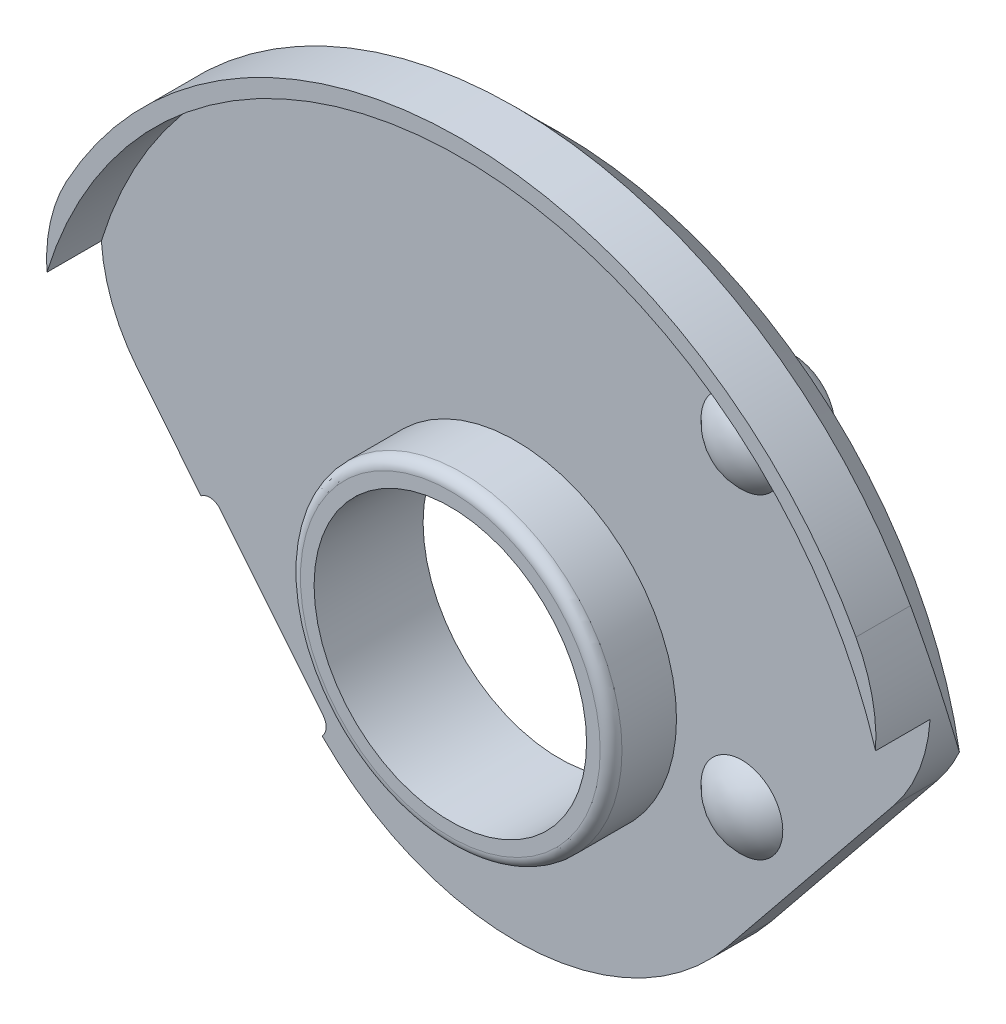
ISO-10303-21;
HEADER;
FILE_DESCRIPTION(('STEP AP214'),'2;1');
FILE_NAME('part.step','',(''),(''),'','','');
FILE_SCHEMA(('AUTOMOTIVE_DESIGN { 1 0 10303 214 1 1 1 1 }'));
ENDSEC;
DATA;
#1=APPLICATION_CONTEXT('core data for automotive mechanical design processes');
#2=APPLICATION_PROTOCOL_DEFINITION('international standard','automotive_design',2000,#1);
#3=PRODUCT_CONTEXT('',#1,'mechanical');
#4=PRODUCT('Part','Part','',(#3));
#5=PRODUCT_RELATED_PRODUCT_CATEGORY('part','',(#4));
#6=PRODUCT_DEFINITION_FORMATION('','',#4);
#7=PRODUCT_DEFINITION_CONTEXT('part definition',#1,'design');
#8=PRODUCT_DEFINITION('design','',#6,#7);
#9=PRODUCT_DEFINITION_SHAPE('','',#8);
#10=(LENGTH_UNIT() NAMED_UNIT(*) SI_UNIT(.MILLI.,.METRE.));
#11=(NAMED_UNIT(*) PLANE_ANGLE_UNIT() SI_UNIT($,.RADIAN.));
#12=(NAMED_UNIT(*) SI_UNIT($,.STERADIAN.) SOLID_ANGLE_UNIT());
#13=UNCERTAINTY_MEASURE_WITH_UNIT(LENGTH_MEASURE(1.E-05),#10,'distance_accuracy_value','');
#14=(GEOMETRIC_REPRESENTATION_CONTEXT(3) GLOBAL_UNCERTAINTY_ASSIGNED_CONTEXT((#13)) GLOBAL_UNIT_ASSIGNED_CONTEXT((#10,
#11,#12)) REPRESENTATION_CONTEXT('',''));
#15=CARTESIAN_POINT('',(0.,0.,0.));
#16=DIRECTION('',(0.,0.,1.));
#17=DIRECTION('',(1.,0.,0.));
#18=AXIS2_PLACEMENT_3D('',#15,#16,#17);
#19=CARTESIAN_POINT('',(3.,4.,-2.2));
#20=DIRECTION('',(0.,0.,1.));
#21=DIRECTION('',(1.,0.,0.));
#22=AXIS2_PLACEMENT_3D('',#19,#20,#21);
#23=PLANE('',#22);
#24=CARTESIAN_POINT('',(3.,4.,-2.2));
#25=DIRECTION('',(0.,0.,-1.));
#26=DIRECTION('',(-1.,0.,0.));
#27=AXIS2_PLACEMENT_3D('',#24,#25,#26);
#28=CIRCLE('',#27,0.460000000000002);
#29=CARTESIAN_POINT('',(2.54,4.,-2.2));
#30=VERTEX_POINT('',#29);
#31=EDGE_CURVE('E20',#30,#30,#28,.F.);
#32=ORIENTED_EDGE('',*,*,#31,.F.);
#33=EDGE_LOOP('',(#32));
#34=FACE_BOUND('',#33,.T.);
#35=ADVANCED_FACE('F16',(#34),#23,.F.);
#36=CARTESIAN_POINT('',(3.,4.,-1.7));
#37=DIRECTION('',(0.,0.,-1.));
#38=DIRECTION('',(-1.,0.,0.));
#39=AXIS2_PLACEMENT_3D('',#36,#37,#38);
#40=DEGENERATE_TOROIDAL_SURFACE('',#39,0.46,0.5,.T.);
#41=ORIENTED_EDGE('',*,*,#31,.T.);
#42=EDGE_LOOP('',(#41));
#43=FACE_BOUND('',#42,.T.);
#44=CARTESIAN_POINT('',(3.,4.,-1.7));
#45=DIRECTION('',(0.,0.,-1.));
#46=DIRECTION('',(-1.,0.,0.));
#47=AXIS2_PLACEMENT_3D('',#44,#45,#46);
#48=CIRCLE('',#47,0.96);
#49=CARTESIAN_POINT('',(2.04,4.,-1.7));
#50=VERTEX_POINT('',#49);
#51=EDGE_CURVE('E119',#50,#50,#48,.F.);
#52=ORIENTED_EDGE('',*,*,#51,.F.);
#53=EDGE_LOOP('',(#52));
#54=FACE_BOUND('',#53,.T.);
#55=ADVANCED_FACE('F18',(#43,#54),#40,.T.);
#56=CARTESIAN_POINT('',(3.,4.,0.));
#57=DIRECTION('',(0.,0.,-1.));
#58=DIRECTION('',(-1.,0.,0.));
#59=AXIS2_PLACEMENT_3D('',#56,#57,#58);
#60=CYLINDRICAL_SURFACE('',#59,0.96);
#61=ORIENTED_EDGE('',*,*,#51,.T.);
#62=EDGE_LOOP('',(#61));
#63=FACE_BOUND('',#62,.T.);
#64=CARTESIAN_POINT('',(3.,4.,-0.8));
#65=DIRECTION('',(0.,0.,-1.));
#66=DIRECTION('',(-1.,0.,0.));
#67=AXIS2_PLACEMENT_3D('',#64,#65,#66);
#68=CIRCLE('',#67,0.96);
#69=CARTESIAN_POINT('',(2.04,4.,-0.8));
#70=VERTEX_POINT('',#69);
#71=EDGE_CURVE('E139',#70,#70,#68,.T.);
#72=ORIENTED_EDGE('',*,*,#71,.T.);
#73=EDGE_LOOP('',(#72));
#74=FACE_BOUND('',#73,.T.);
#75=ADVANCED_FACE('F504',(#63,#74),#60,.T.);
#76=CARTESIAN_POINT('',(0.,0.,0.));
#77=DIRECTION('',(0.,0.,-1.));
#78=DIRECTION('',(-1.,0.,0.));
#79=AXIS2_PLACEMENT_3D('',#76,#77,#78);
#80=CYLINDRICAL_SURFACE('',#79,2.5);
#81=CARTESIAN_POINT('',(0.,0.,-0.8));
#82=DIRECTION('',(0.,0.,-1.));
#83=DIRECTION('',(-1.,0.,0.));
#84=AXIS2_PLACEMENT_3D('',#81,#82,#83);
#85=CIRCLE('',#84,2.5);
#86=CARTESIAN_POINT('',(-2.5,0.,-0.8));
#87=VERTEX_POINT('',#86);
#88=EDGE_CURVE('E142',#87,#87,#85,.T.);
#89=ORIENTED_EDGE('',*,*,#88,.T.);
#90=EDGE_LOOP('',(#89));
#91=FACE_BOUND('',#90,.T.);
#92=CARTESIAN_POINT('',(0.,0.,1.2));
#93=DIRECTION('',(0.,0.,-1.));
#94=DIRECTION('',(-1.,0.,0.));
#95=AXIS2_PLACEMENT_3D('',#92,#93,#94);
#96=CIRCLE('',#95,2.5);
#97=CARTESIAN_POINT('',(-2.5,0.,1.2));
#98=VERTEX_POINT('',#97);
#99=EDGE_CURVE('E132',#98,#98,#96,.F.);
#100=ORIENTED_EDGE('',*,*,#99,.T.);
#101=EDGE_LOOP('',(#100));
#102=FACE_BOUND('',#101,.T.);
#103=ADVANCED_FACE('F498',(#91,#102),#80,.F.);
#104=CARTESIAN_POINT('',(0.,0.,0.));
#105=DIRECTION('',(0.,0.,-1.));
#106=DIRECTION('',(-1.,0.,0.));
#107=AXIS2_PLACEMENT_3D('',#104,#105,#106);
#108=CYLINDRICAL_SURFACE('',#107,8.25);
#109=CARTESIAN_POINT('',(0.,0.,1.));
#110=DIRECTION('',(0.,0.,-1.));
#111=DIRECTION('',(-1.,0.,0.));
#112=AXIS2_PLACEMENT_3D('',#109,#110,#111);
#113=CIRCLE('',#112,8.25);
#114=CARTESIAN_POINT('',(7.24285548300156,3.95013220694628,1.));
#115=VERTEX_POINT('',#114);
#116=CARTESIAN_POINT('',(-7.24285548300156,3.95013220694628,1.));
#117=VERTEX_POINT('',#116);
#118=EDGE_CURVE('E112',#115,#117,#113,.F.);
#119=ORIENTED_EDGE('',*,*,#118,.F.);
#120=DIRECTION('',(0.,0.,-1.));
#121=VECTOR('',#120,1.);
#122=CARTESIAN_POINT('',(7.24285548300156,3.95013220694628,0.));
#123=LINE('',#122,#121);
#124=CARTESIAN_POINT('',(7.24285548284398,3.95013220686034,5.38473404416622E-10));
#125=VERTEX_POINT('',#124);
#126=EDGE_CURVE('E103',#115,#125,#123,.T.);
#127=ORIENTED_EDGE('',*,*,#126,.T.);
#128=CARTESIAN_POINT('',(0.,0.,3.5898367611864E-10));
#129=DIRECTION('',(0.,0.,1.));
#130=DIRECTION('',(0.,1.,0.));
#131=AXIS2_PLACEMENT_3D('',#128,#129,#130);
#132=CIRCLE('',#131,8.24999999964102);
#133=CARTESIAN_POINT('',(-7.24285548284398,3.95013220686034,5.38473404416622E-10));
#134=VERTEX_POINT('',#133);
#135=EDGE_CURVE('E115',#134,#125,#132,.F.);
#136=ORIENTED_EDGE('',*,*,#135,.F.);
#137=DIRECTION('',(0.,0.,-1.));
#138=VECTOR('',#137,1.);
#139=CARTESIAN_POINT('',(-7.24285548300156,3.95013220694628,0.));
#140=LINE('',#139,#138);
#141=EDGE_CURVE('E108',#134,#117,#140,.F.);
#142=ORIENTED_EDGE('',*,*,#141,.T.);
#143=EDGE_LOOP('',(#119,#127,#136,#142));
#144=FACE_BOUND('',#143,.T.);
#145=ADVANCED_FACE('F110',(#144),#108,.T.);
#146=CARTESIAN_POINT('',(4.25,5.1,-0.561437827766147));
#147=DIRECTION('',(1.,0.,0.));
#148=DIRECTION('',(0.,1.,0.));
#149=AXIS2_PLACEMENT_3D('',#146,#147,#148);
#150=SPHERICAL_SURFACE('',#149,1.);
#151=CARTESIAN_POINT('',(4.25,4.35,0.1));
#152=CARTESIAN_POINT('',(4.2078721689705,4.35000186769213,0.0999999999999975));
#153=CARTESIAN_POINT('',(4.16571379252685,4.35356141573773,0.1));
#154=CARTESIAN_POINT('',(4.08255809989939,4.36771177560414,0.0999999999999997));
#155=CARTESIAN_POINT('',(4.04156224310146,4.37831104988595,0.0999999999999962));
#156=CARTESIAN_POINT('',(3.96195370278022,4.40623722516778,0.0999999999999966));
#157=CARTESIAN_POINT('',(3.92333957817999,4.42356001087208,0.100000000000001));
#158=CARTESIAN_POINT('',(3.84956802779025,4.46444278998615,0.0999999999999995));
#159=CARTESIAN_POINT('',(3.81441066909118,4.48800290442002,0.0999999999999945));
#160=CARTESIAN_POINT('',(3.7485510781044,4.54069042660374,0.100000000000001));
#161=CARTESIAN_POINT('',(3.71784871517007,4.56981767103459,0.100000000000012));
#162=CARTESIAN_POINT('',(3.66176867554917,4.63281438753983,0.0999999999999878));
#163=CARTESIAN_POINT('',(3.63639120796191,4.66668404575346,0.0999999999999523));
#164=CARTESIAN_POINT('',(3.59168322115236,4.73820253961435,0.0999999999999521));
#165=CARTESIAN_POINT('',(3.57235258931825,4.77585130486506,0.0999999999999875));
#166=CARTESIAN_POINT('',(3.54028642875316,4.85385972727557,0.100000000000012));
#167=CARTESIAN_POINT('',(3.52755088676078,4.89421937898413,0.100000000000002));
#168=CARTESIAN_POINT('',(3.50903634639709,4.97650402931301,0.0999999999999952));
#169=CARTESIAN_POINT('',(3.50325736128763,5.01842903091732,0.099999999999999));
#170=CARTESIAN_POINT('',(3.49882003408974,5.10265410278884,0.100000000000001));
#171=CARTESIAN_POINT('',(3.50016167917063,5.14495417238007,0.0999999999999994));
#172=CARTESIAN_POINT('',(3.509927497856,5.22872869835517,0.0999999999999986));
#173=CARTESIAN_POINT('',(3.51835167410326,5.27020315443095,0.0999999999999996));
#174=CARTESIAN_POINT('',(3.54204343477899,5.3511491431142,0.1));
#175=CARTESIAN_POINT('',(3.55731102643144,5.39062067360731,0.1));
#176=CARTESIAN_POINT('',(3.59425621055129,5.46644027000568,0.100000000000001));
#177=CARTESIAN_POINT('',(3.61593380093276,5.50278833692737,0.100000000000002));
#178=CARTESIAN_POINT('',(3.66508361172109,5.57132919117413,0.0999999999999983));
#179=CARTESIAN_POINT('',(3.69255582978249,5.60352198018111,0.0999999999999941));
#180=CARTESIAN_POINT('',(3.75251504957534,5.66283844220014,0.100000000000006));
#181=CARTESIAN_POINT('',(3.78500205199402,5.68996211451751,0.100000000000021));
#182=CARTESIAN_POINT('',(3.85406863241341,5.73837037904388,0.0999999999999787));
#183=CARTESIAN_POINT('',(3.89064821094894,5.75965497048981,0.0999999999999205));
#184=CARTESIAN_POINT('',(3.9668615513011,5.79578086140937,0.0999999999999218));
#185=CARTESIAN_POINT('',(4.00649531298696,5.81062216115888,0.0999999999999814));
#186=CARTESIAN_POINT('',(4.08769193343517,5.83344016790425,0.100000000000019));
#187=CARTESIAN_POINT('',(4.12925479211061,5.84141687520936,0.0999999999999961));
#188=CARTESIAN_POINT('',(4.21312976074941,5.85027926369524,0.0999999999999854));
#189=CARTESIAN_POINT('',(4.25544187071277,5.85116494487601,0.0999999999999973));
#190=CARTESIAN_POINT('',(4.33961422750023,5.84582013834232,0.100000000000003));
#191=CARTESIAN_POINT('',(4.38147447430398,5.83958965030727,0.0999999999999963));
#192=CARTESIAN_POINT('',(4.46355481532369,5.82018937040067,0.0999999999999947));
#193=CARTESIAN_POINT('',(4.50377490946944,5.80701957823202,0.0999999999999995));
#194=CARTESIAN_POINT('',(4.58143320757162,5.77411454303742,0.100000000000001));
#195=CARTESIAN_POINT('',(4.6188714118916,5.75437930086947,0.0999999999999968));
#196=CARTESIAN_POINT('',(4.68990317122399,5.70890359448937,0.0999999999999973));
#197=CARTESIAN_POINT('',(4.72349672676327,5.68316313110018,0.100000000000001));
#198=CARTESIAN_POINT('',(4.78588558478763,5.62640766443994,0.0999999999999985));
#199=CARTESIAN_POINT('',(4.81468088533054,5.59539265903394,0.0999999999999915));
#200=CARTESIAN_POINT('',(4.86665581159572,5.52896853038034,0.0999999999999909));
#201=CARTESIAN_POINT('',(4.88983543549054,5.49355940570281,0.0999999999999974));
#202=CARTESIAN_POINT('',(4.92992097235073,5.41935224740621,0.100000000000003));
#203=CARTESIAN_POINT('',(4.94682689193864,5.38055421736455,0.100000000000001));
#204=CARTESIAN_POINT('',(4.97388514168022,5.30067059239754,0.1));
#205=CARTESIAN_POINT('',(4.98403747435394,5.25958499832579,0.1));
#206=CARTESIAN_POINT('',(4.99730037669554,5.17629245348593,0.1));
#207=CARTESIAN_POINT('',(5.00041093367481,5.13408550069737,0.1));
#208=CARTESIAN_POINT('',(4.99950195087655,5.04974852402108,0.1));
#209=CARTESIAN_POINT('',(4.99548242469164,5.00761849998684,0.1));
#210=CARTESIAN_POINT('',(4.98042738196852,4.92463116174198,0.0999999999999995));
#211=CARTESIAN_POINT('',(4.96939185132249,4.88377385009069,0.0999999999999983));
#212=CARTESIAN_POINT('',(4.94061780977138,4.8044911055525,0.100000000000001));
#213=CARTESIAN_POINT('',(4.922879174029,4.76606571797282,0.100000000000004));
#214=CARTESIAN_POINT('',(4.88120323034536,4.69273991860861,0.0999999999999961));
#215=CARTESIAN_POINT('',(4.85726616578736,4.65783936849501,0.0999999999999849));
#216=CARTESIAN_POINT('',(4.80387210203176,4.59255127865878,0.100000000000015));
#217=CARTESIAN_POINT('',(4.77441494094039,4.56216387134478,0.100000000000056));
#218=CARTESIAN_POINT('',(4.71081655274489,4.50676632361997,0.0999999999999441));
#219=CARTESIAN_POINT('',(4.67667541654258,4.48175607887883,0.0999999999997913));
#220=CARTESIAN_POINT('',(4.60466112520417,4.43780914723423,0.0999999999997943));
#221=CARTESIAN_POINT('',(4.56678570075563,4.41887618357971,0.0999999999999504));
#222=CARTESIAN_POINT('',(4.4884235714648,4.38765954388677,0.10000000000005));
#223=CARTESIAN_POINT('',(4.447940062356,4.3753678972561,0.0999999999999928));
#224=CARTESIAN_POINT('',(4.38099879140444,4.36105879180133,0.0999999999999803));
#225=CARTESIAN_POINT('',(4.35497599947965,4.35691692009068,0.0999999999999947));
#226=CARTESIAN_POINT('',(4.30263944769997,4.35138694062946,0.100000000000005));
#227=CARTESIAN_POINT('',(4.27632568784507,4.34999883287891,0.100000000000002));
#228=CARTESIAN_POINT('',(4.25,4.35,0.1));
#229=B_SPLINE_CURVE_WITH_KNOTS('',3,(#151,#152,#153,#154,#155,#156,#157,#158,#159,#160,#161,
#162,#163,#164,#165,#166,#167,#168,#169,#170,#171,#172,#173,#174,#175,#176,#177,#178,#179,#180,
#181,#182,#183,#184,#185,#186,#187,#188,#189,#190,#191,#192,#193,#194,#195,#196,#197,#198,#199,
#200,#201,#202,#203,#204,#205,#206,#207,#208,#209,#210,#211,#212,#213,#214,#215,#216,#217,#218,
#219,#220,#221,#222,#223,#224,#225,#226,#227,#228),.UNSPECIFIED.,.T.,.F.,(4,2,2,2,2,2,2,2,2,2,2,
2,2,2,2,2,2,2,2,2,2,2,2,2,2,2,2,2,2,2,2,2,2,2,2,2,2,2,4),(0.,0.126287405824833,0.25272689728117,
0.37908911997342,0.505453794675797,0.631814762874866,0.758180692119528,0.884544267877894,
1.01090758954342,1.13727115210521,1.26363448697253,1.38999786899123,1.51636138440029,
1.64272485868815,1.76908828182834,1.89545172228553,2.02181517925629,2.14817863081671,
2.27454207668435,2.40090552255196,2.52726897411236,2.65363243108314,2.77999587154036,
2.90635929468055,3.03272276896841,3.15908628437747,3.28544966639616,3.41181300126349,
3.53817656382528,3.66453988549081,3.79090346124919,3.91726939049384,4.0436303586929,
4.1699950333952,4.29635725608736,4.42279674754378,4.5490841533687,4.62800117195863,
4.70691819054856),.UNSPECIFIED.);
#230=CARTESIAN_POINT('',(4.25,4.35,0.1));
#231=VERTEX_POINT('',#230);
#232=EDGE_CURVE('E147',#231,#231,#229,.T.);
#233=ORIENTED_EDGE('',*,*,#232,.F.);
#234=EDGE_LOOP('',(#233));
#235=FACE_BOUND('',#234,.T.);
#236=ADVANCED_FACE('F163',(#235),#150,.T.);
#237=CARTESIAN_POINT('',(4.25,-0.7,-0.561437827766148));
#238=DIRECTION('',(1.,0.,0.));
#239=DIRECTION('',(0.,1.,0.));
#240=AXIS2_PLACEMENT_3D('',#237,#238,#239);
#241=SPHERICAL_SURFACE('',#240,1.);
#242=CARTESIAN_POINT('',(4.25,-1.45,0.0999999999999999));
#243=CARTESIAN_POINT('',(4.2078721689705,-1.44999813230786,0.0999999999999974));
#244=CARTESIAN_POINT('',(4.16571379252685,-1.44643858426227,0.1));
#245=CARTESIAN_POINT('',(4.08255809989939,-1.43228822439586,0.0999999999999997));
#246=CARTESIAN_POINT('',(4.04156224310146,-1.42168895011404,0.0999999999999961));
#247=CARTESIAN_POINT('',(3.96195370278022,-1.39376277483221,0.0999999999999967));
#248=CARTESIAN_POINT('',(3.92333957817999,-1.37643998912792,0.100000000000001));
#249=CARTESIAN_POINT('',(3.84956802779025,-1.33555721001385,0.0999999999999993));
#250=CARTESIAN_POINT('',(3.81441066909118,-1.31199709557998,0.0999999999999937));
#251=CARTESIAN_POINT('',(3.7485510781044,-1.25930957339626,0.1));
#252=CARTESIAN_POINT('',(3.71784871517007,-1.23018232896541,0.100000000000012));
#253=CARTESIAN_POINT('',(3.66176867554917,-1.16718561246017,0.0999999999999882));
#254=CARTESIAN_POINT('',(3.63639120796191,-1.13331595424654,0.0999999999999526));
#255=CARTESIAN_POINT('',(3.59168322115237,-1.06179746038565,0.0999999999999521));
#256=CARTESIAN_POINT('',(3.57235258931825,-1.02414869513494,0.0999999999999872));
#257=CARTESIAN_POINT('',(3.54028642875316,-0.94614027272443,0.100000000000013));
#258=CARTESIAN_POINT('',(3.52755088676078,-0.905780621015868,0.100000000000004));
#259=CARTESIAN_POINT('',(3.50903634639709,-0.823495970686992,0.0999999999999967));
#260=CARTESIAN_POINT('',(3.50325736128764,-0.781570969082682,0.0999999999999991));
#261=CARTESIAN_POINT('',(3.49882003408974,-0.697345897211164,0.100000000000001));
#262=CARTESIAN_POINT('',(3.50016167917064,-0.655045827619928,0.1));
#263=CARTESIAN_POINT('',(3.509927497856,-0.571271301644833,0.0999999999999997));
#264=CARTESIAN_POINT('',(3.51835167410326,-0.529796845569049,0.1));
#265=CARTESIAN_POINT('',(3.542043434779,-0.448850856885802,0.1));
#266=CARTESIAN_POINT('',(3.55731102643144,-0.40937932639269,0.0999999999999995));
#267=CARTESIAN_POINT('',(3.59425621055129,-0.333559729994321,0.1));
#268=CARTESIAN_POINT('',(3.61593380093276,-0.297211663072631,0.100000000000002));
#269=CARTESIAN_POINT('',(3.66508361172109,-0.228670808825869,0.0999999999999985));
#270=CARTESIAN_POINT('',(3.69255582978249,-0.196478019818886,0.0999999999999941));
#271=CARTESIAN_POINT('',(3.75251504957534,-0.137161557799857,0.100000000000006));
#272=CARTESIAN_POINT('',(3.78500205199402,-0.110037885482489,0.100000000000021));
#273=CARTESIAN_POINT('',(3.85406863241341,-0.0616296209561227,0.0999999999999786));
#274=CARTESIAN_POINT('',(3.89064821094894,-0.0403450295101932,0.0999999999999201));
#275=CARTESIAN_POINT('',(3.9668615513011,-0.00421913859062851,0.0999999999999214));
#276=CARTESIAN_POINT('',(4.00649531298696,0.0106221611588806,0.0999999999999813));
#277=CARTESIAN_POINT('',(4.08769193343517,0.0334401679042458,0.100000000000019));
#278=CARTESIAN_POINT('',(4.12925479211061,0.041416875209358,0.0999999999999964));
#279=CARTESIAN_POINT('',(4.21312976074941,0.0502792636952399,0.0999999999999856));
#280=CARTESIAN_POINT('',(4.25544187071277,0.0511649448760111,0.0999999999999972));
#281=CARTESIAN_POINT('',(4.33961422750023,0.0458201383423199,0.100000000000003));
#282=CARTESIAN_POINT('',(4.38147447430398,0.0395896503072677,0.099999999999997));
#283=CARTESIAN_POINT('',(4.46355481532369,0.0201893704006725,0.0999999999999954));
#284=CARTESIAN_POINT('',(4.50377490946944,0.00701957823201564,0.0999999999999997));
#285=CARTESIAN_POINT('',(4.58143320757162,-0.025885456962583,0.1));
#286=CARTESIAN_POINT('',(4.6188714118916,-0.0456206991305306,0.0999999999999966));
#287=CARTESIAN_POINT('',(4.68990317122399,-0.0910964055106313,0.0999999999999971));
#288=CARTESIAN_POINT('',(4.72349672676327,-0.11683686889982,0.100000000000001));
#289=CARTESIAN_POINT('',(4.78588558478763,-0.173592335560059,0.0999999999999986));
#290=CARTESIAN_POINT('',(4.81468088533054,-0.204607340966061,0.0999999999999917));
#291=CARTESIAN_POINT('',(4.86665581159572,-0.271031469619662,0.0999999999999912));
#292=CARTESIAN_POINT('',(4.88983543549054,-0.306440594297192,0.0999999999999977));
#293=CARTESIAN_POINT('',(4.92992097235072,-0.380647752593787,0.100000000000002));
#294=CARTESIAN_POINT('',(4.94682689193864,-0.419445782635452,0.100000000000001));
#295=CARTESIAN_POINT('',(4.97388514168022,-0.499329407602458,0.0999999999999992));
#296=CARTESIAN_POINT('',(4.98403747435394,-0.540415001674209,0.0999999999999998));
#297=CARTESIAN_POINT('',(4.99730037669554,-0.623707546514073,0.1));
#298=CARTESIAN_POINT('',(5.00041093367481,-0.665914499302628,0.1));
#299=CARTESIAN_POINT('',(4.99950195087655,-0.750251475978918,0.1));
#300=CARTESIAN_POINT('',(4.99548242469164,-0.792381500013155,0.1));
#301=CARTESIAN_POINT('',(4.98042738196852,-0.875368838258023,0.0999999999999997));
#302=CARTESIAN_POINT('',(4.96939185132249,-0.916226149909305,0.0999999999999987));
#303=CARTESIAN_POINT('',(4.94061780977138,-0.995508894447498,0.100000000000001));
#304=CARTESIAN_POINT('',(4.92287917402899,-1.03393428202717,0.100000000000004));
#305=CARTESIAN_POINT('',(4.88120323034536,-1.10726008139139,0.0999999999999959));
#306=CARTESIAN_POINT('',(4.85726616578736,-1.14216063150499,0.0999999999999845));
#307=CARTESIAN_POINT('',(4.80387210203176,-1.20744872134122,0.100000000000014));
#308=CARTESIAN_POINT('',(4.77441494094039,-1.23783612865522,0.100000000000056));
#309=CARTESIAN_POINT('',(4.71081655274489,-1.29323367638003,0.0999999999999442));
#310=CARTESIAN_POINT('',(4.67667541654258,-1.31824392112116,0.0999999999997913));
#311=CARTESIAN_POINT('',(4.60466112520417,-1.36219085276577,0.0999999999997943));
#312=CARTESIAN_POINT('',(4.56678570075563,-1.38112381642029,0.0999999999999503));
#313=CARTESIAN_POINT('',(4.4884235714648,-1.41234045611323,0.10000000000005));
#314=CARTESIAN_POINT('',(4.447940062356,-1.4246321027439,0.0999999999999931));
#315=CARTESIAN_POINT('',(4.38099879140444,-1.43894120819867,0.0999999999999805));
#316=CARTESIAN_POINT('',(4.35497599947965,-1.44308307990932,0.0999999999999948));
#317=CARTESIAN_POINT('',(4.30263944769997,-1.44861305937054,0.100000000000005));
#318=CARTESIAN_POINT('',(4.27632568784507,-1.45000116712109,0.100000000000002));
#319=CARTESIAN_POINT('',(4.25,-1.45,0.0999999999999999));
#320=B_SPLINE_CURVE_WITH_KNOTS('',3,(#242,#243,#244,#245,#246,#247,#248,#249,#250,#251,#252,
#253,#254,#255,#256,#257,#258,#259,#260,#261,#262,#263,#264,#265,#266,#267,#268,#269,#270,#271,
#272,#273,#274,#275,#276,#277,#278,#279,#280,#281,#282,#283,#284,#285,#286,#287,#288,#289,#290,
#291,#292,#293,#294,#295,#296,#297,#298,#299,#300,#301,#302,#303,#304,#305,#306,#307,#308,#309,
#310,#311,#312,#313,#314,#315,#316,#317,#318,#319),.UNSPECIFIED.,.T.,.F.,(4,2,2,2,2,2,2,2,2,2,2,
2,2,2,2,2,2,2,2,2,2,2,2,2,2,2,2,2,2,2,2,2,2,2,2,2,2,2,4),(0.,0.126287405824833,0.25272689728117,
0.37908911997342,0.505453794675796,0.631814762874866,0.758180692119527,0.884544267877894,
1.01090758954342,1.13727115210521,1.26363448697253,1.38999786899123,1.51636138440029,
1.64272485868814,1.76908828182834,1.89545172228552,2.02181517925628,2.14817863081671,
2.27454207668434,2.40090552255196,2.52726897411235,2.65363243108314,2.77999587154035,
2.90635929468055,3.03272276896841,3.15908628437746,3.28544966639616,3.41181300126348,
3.53817656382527,3.66453988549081,3.79090346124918,3.91726939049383,4.04363035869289,
4.1699950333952,4.29635725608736,4.42279674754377,4.5490841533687,4.62800117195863,
4.70691819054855),.UNSPECIFIED.);
#321=CARTESIAN_POINT('',(4.25,-1.45,0.0999999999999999));
#322=VERTEX_POINT('',#321);
#323=EDGE_CURVE('E154',#322,#322,#320,.T.);
#324=ORIENTED_EDGE('',*,*,#323,.F.);
#325=EDGE_LOOP('',(#324));
#326=FACE_BOUND('',#325,.T.);
#327=ADVANCED_FACE('F168',(#326),#241,.T.);
#328=CARTESIAN_POINT('',(0.,0.,1.2));
#329=DIRECTION('',(0.,0.,-1.));
#330=DIRECTION('',(-1.,0.,0.));
#331=AXIS2_PLACEMENT_3D('',#328,#329,#330);
#332=PLANE('',#331);
#333=ORIENTED_EDGE('',*,*,#99,.F.);
#334=EDGE_LOOP('',(#333));
#335=FACE_BOUND('',#334,.T.);
#336=CARTESIAN_POINT('',(0.,0.,1.2));
#337=DIRECTION('',(0.,0.,-1.));
#338=DIRECTION('',(1.,0.,0.));
#339=AXIS2_PLACEMENT_3D('',#336,#337,#338);
#340=CIRCLE('',#339,2.75);
#341=CARTESIAN_POINT('',(2.75,0.,1.2));
#342=VERTEX_POINT('',#341);
#343=EDGE_CURVE('E284',#342,#342,#340,.T.);
#344=ORIENTED_EDGE('',*,*,#343,.F.);
#345=EDGE_LOOP('',(#344));
#346=FACE_BOUND('',#345,.T.);
#347=ADVANCED_FACE('F288',(#335,#346),#332,.F.);
#348=CARTESIAN_POINT('',(0.,5.77962089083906,1.));
#349=DIRECTION('',(0.,0.,1.));
#350=DIRECTION('',(1.,0.,0.));
#351=AXIS2_PLACEMENT_3D('',#348,#349,#350);
#352=PLANE('',#351);
#353=CARTESIAN_POINT('',(0.,0.,1.));
#354=DIRECTION('',(0.,0.,1.));
#355=DIRECTION('',(1.,0.,0.));
#356=AXIS2_PLACEMENT_3D('',#353,#354,#355);
#357=CIRCLE('',#356,7.95);
#358=CARTESIAN_POINT('',(-7.60302402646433,2.32304232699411,1.));
#359=VERTEX_POINT('',#358);
#360=CARTESIAN_POINT('',(7.60302402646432,2.32304232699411,1.));
#361=VERTEX_POINT('',#360);
#362=EDGE_CURVE('E246',#359,#361,#357,.F.);
#363=ORIENTED_EDGE('',*,*,#362,.T.);
#364=CARTESIAN_POINT('',(4.60908985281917,2.51372049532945,1.));
#365=DIRECTION('',(0.,0.,-1.));
#366=DIRECTION('',(-1.,0.,0.));
#367=AXIS2_PLACEMENT_3D('',#364,#365,#366);
#368=CIRCLE('',#367,3.);
#369=EDGE_CURVE('E129',#361,#115,#368,.F.);
#370=ORIENTED_EDGE('',*,*,#369,.T.);
#371=ORIENTED_EDGE('',*,*,#118,.T.);
#372=CARTESIAN_POINT('',(-4.60908985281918,2.51372049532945,1.));
#373=DIRECTION('',(0.,0.,-1.));
#374=DIRECTION('',(-1.,0.,0.));
#375=AXIS2_PLACEMENT_3D('',#372,#373,#374);
#376=CIRCLE('',#375,3.);
#377=EDGE_CURVE('E122',#117,#359,#376,.F.);
#378=ORIENTED_EDGE('',*,*,#377,.T.);
#379=EDGE_LOOP('',(#363,#370,#371,#378));
#380=FACE_BOUND('',#379,.T.);
#381=ADVANCED_FACE('F131',(#380),#352,.T.);
#382=CARTESIAN_POINT('',(0.,5.77962089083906,-0.8));
#383=DIRECTION('',(0.,0.,1.));
#384=DIRECTION('',(1.,0.,0.));
#385=AXIS2_PLACEMENT_3D('',#382,#383,#384);
#386=PLANE('',#385);
#387=ORIENTED_EDGE('',*,*,#88,.F.);
#388=EDGE_LOOP('',(#387));
#389=FACE_BOUND('',#388,.T.);
#390=ORIENTED_EDGE('',*,*,#71,.F.);
#391=EDGE_LOOP('',(#390));
#392=FACE_BOUND('',#391,.T.);
#393=CARTESIAN_POINT('',(4.60908985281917,2.51372049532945,-0.8));
#394=DIRECTION('',(0.,0.,-1.));
#395=DIRECTION('',(-1.,0.,0.));
#396=AXIS2_PLACEMENT_3D('',#393,#394,#395);
#397=CIRCLE('',#396,3.);
#398=CARTESIAN_POINT('',(6.94052773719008,0.625759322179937,-0.8));
#399=VERTEX_POINT('',#398);
#400=CARTESIAN_POINT('',(7.34045278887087,1.27289153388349,-0.800000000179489));
#401=VERTEX_POINT('',#400);
#402=EDGE_CURVE('E137',#399,#401,#397,.F.);
#403=ORIENTED_EDGE('',*,*,#402,.F.);
#404=DIRECTION('',(0.629320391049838,0.77714596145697,0.));
#405=VECTOR('',#404,1.);
#406=CARTESIAN_POINT('',(3.88572980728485,-3.14660195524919,-0.8));
#407=LINE('',#406,#405);
#408=CARTESIAN_POINT('',(3.88572980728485,-3.14660195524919,-0.8));
#409=VERTEX_POINT('',#408);
#410=EDGE_CURVE('E269',#409,#399,#407,.T.);
#411=ORIENTED_EDGE('',*,*,#410,.F.);
#412=CARTESIAN_POINT('',(0.,0.,-0.8));
#413=DIRECTION('',(0.,0.,-1.));
#414=DIRECTION('',(-1.,0.,0.));
#415=AXIS2_PLACEMENT_3D('',#412,#413,#414);
#416=CIRCLE('',#415,5.);
#417=CARTESIAN_POINT('',(-3.55247410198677,-3.51851215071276,-0.8));
#418=VERTEX_POINT('',#417);
#419=EDGE_CURVE('E224',#418,#409,#416,.F.);
#420=ORIENTED_EDGE('',*,*,#419,.F.);
#421=CARTESIAN_POINT('',(-3.7283997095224,-3.34088844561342,-0.8));
#422=DIRECTION('',(0.,0.,-1.));
#423=DIRECTION('',(-1.,0.,0.));
#424=AXIS2_PLACEMENT_3D('',#421,#422,#423);
#425=CIRCLE('',#424,0.250000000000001);
#426=CARTESIAN_POINT('',(-3.53411321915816,-3.18355834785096,-0.8));
#427=VERTEX_POINT('',#426);
#428=EDGE_CURVE('E358',#418,#427,#425,.F.);
#429=ORIENTED_EDGE('',*,*,#428,.T.);
#430=DIRECTION('',(0.629320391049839,-0.77714596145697,0.));
#431=VECTOR('',#430,1.);
#432=CARTESIAN_POINT('',(-5.42280317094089,-0.851220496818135,-0.8));
#433=LINE('',#432,#431);
#434=CARTESIAN_POINT('',(-5.4228031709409,-0.851220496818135,-0.8));
#435=VERTEX_POINT('',#434);
#436=EDGE_CURVE('E273',#435,#427,#433,.T.);
#437=ORIENTED_EDGE('',*,*,#436,.F.);
#438=CARTESIAN_POINT('',(-5.61708966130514,-1.0085505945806,-0.8));
#439=DIRECTION('',(0.,0.,-1.));
#440=DIRECTION('',(-1.,0.,0.));
#441=AXIS2_PLACEMENT_3D('',#438,#439,#440);
#442=CIRCLE('',#441,0.250000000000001);
#443=CARTESIAN_POINT('',(-5.7744197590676,-0.814264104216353,-0.8));
#444=VERTEX_POINT('',#443);
#445=EDGE_CURVE('E276',#435,#444,#442,.F.);
#446=ORIENTED_EDGE('',*,*,#445,.T.);
#447=DIRECTION('',(0.629320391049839,-0.77714596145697,0.));
#448=VECTOR('',#447,1.);
#449=CARTESIAN_POINT('',(-6.94052773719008,0.625759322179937,-0.8));
#450=LINE('',#449,#448);
#451=CARTESIAN_POINT('',(-6.94052773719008,0.625759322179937,-0.8));
#452=VERTEX_POINT('',#451);
#453=EDGE_CURVE('E277',#452,#444,#450,.T.);
#454=ORIENTED_EDGE('',*,*,#453,.F.);
#455=CARTESIAN_POINT('',(-4.60908985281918,2.51372049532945,-0.8));
#456=DIRECTION('',(0.,0.,-1.));
#457=DIRECTION('',(-1.,0.,0.));
#458=AXIS2_PLACEMENT_3D('',#455,#456,#457);
#459=CIRCLE('',#458,3.);
#460=CARTESIAN_POINT('',(-7.34045278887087,1.27289153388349,-0.800000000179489));
#461=VERTEX_POINT('',#460);
#462=EDGE_CURVE('E245',#461,#452,#459,.F.);
#463=ORIENTED_EDGE('',*,*,#462,.F.);
#464=CARTESIAN_POINT('',(0.,0.,-0.800000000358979));
#465=DIRECTION('',(0.,0.,1.));
#466=DIRECTION('',(1.,0.,0.));
#467=AXIS2_PLACEMENT_3D('',#464,#465,#466);
#468=CIRCLE('',#467,7.45000000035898);
#469=EDGE_CURVE('E145',#401,#461,#468,.T.);
#470=ORIENTED_EDGE('',*,*,#469,.F.);
#471=EDGE_LOOP('',(#403,#411,#420,#429,#437,#446,#454,#463,#470));
#472=FACE_BOUND('',#471,.T.);
#473=ADVANCED_FACE('F234',(#389,#392,#472),#386,.F.);
#474=CARTESIAN_POINT('',(0.,0.,3.58982971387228E-10));
#475=DIRECTION('',(0.,0.,1.));
#476=DIRECTION('',(1.,0.,0.));
#477=AXIS2_PLACEMENT_3D('',#474,#475,#476);
#478=CONICAL_SURFACE('',#477,8.24999999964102,0.7853981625);
#479=CARTESIAN_POINT('',(-7.24285548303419,3.95013220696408,7.02565920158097E-10));
#480=CARTESIAN_POINT('',(-7.27853072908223,3.88474691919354,6.14051450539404E-06));
#481=CARTESIAN_POINT('',(-7.31174406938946,3.81802712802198,-0.00176509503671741));
#482=CARTESIAN_POINT('',(-7.37305561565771,3.68248200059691,-0.00881469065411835));
#483=CARTESIAN_POINT('',(-7.40115548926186,3.61365735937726,-0.014091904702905));
#484=CARTESIAN_POINT('',(-7.45195727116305,3.47473718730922,-0.0280742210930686));
#485=CARTESIAN_POINT('',(-7.47468300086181,3.40464880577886,-0.0367637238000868));
#486=CARTESIAN_POINT('',(-7.51482072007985,3.26346860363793,-0.0574747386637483));
#487=CARTESIAN_POINT('',(-7.53223249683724,3.19237674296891,-0.069496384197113));
#488=CARTESIAN_POINT('',(-7.57642183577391,2.9785361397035,-0.110375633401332));
#489=CARTESIAN_POINT('',(-7.59524489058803,2.83496923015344,-0.144073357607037));
#490=CARTESIAN_POINT('',(-7.61228210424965,2.54984997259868,-0.223191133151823));
#491=CARTESIAN_POINT('',(-7.61047339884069,2.40830003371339,-0.26862413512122));
#492=CARTESIAN_POINT('',(-7.58721001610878,2.12357645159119,-0.372389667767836));
#493=CARTESIAN_POINT('',(-7.56476969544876,1.98068058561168,-0.431256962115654));
#494=CARTESIAN_POINT('',(-7.50120597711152,1.70389692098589,-0.558754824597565));
#495=CARTESIAN_POINT('',(-7.46009771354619,1.57000192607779,-0.627377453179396));
#496=CARTESIAN_POINT('',(-7.38903083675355,1.38424196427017,-0.732608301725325));
#497=CARTESIAN_POINT('',(-7.36548218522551,1.3279692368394,-0.765929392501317));
#498=CARTESIAN_POINT('',(-7.34045278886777,1.27289153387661,-0.800000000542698));
#499=B_SPLINE_CURVE_WITH_KNOTS('',3,(#479,#480,#481,#482,#483,#484,#485,#486,#487,#488,#489,
#490,#491,#492,#493,#494,#495,#496,#497,#498),.UNSPECIFIED.,.F.,.F.,(4,2,2,2,2,2,2,2,2,4),(0.,
0.223368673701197,0.446664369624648,0.66895091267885,0.891246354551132,1.3350364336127,
1.77931837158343,2.24599396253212,2.71229189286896,2.92066672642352),.UNSPECIFIED.);
#500=EDGE_CURVE('E239',#134,#461,#499,.T.);
#501=ORIENTED_EDGE('',*,*,#500,.F.);
#502=ORIENTED_EDGE('',*,*,#135,.T.);
#503=CARTESIAN_POINT('',(7.34045278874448,1.27289153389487,-0.800000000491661));
#504=CARTESIAN_POINT('',(7.37202516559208,1.3423767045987,-0.75702049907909));
#505=CARTESIAN_POINT('',(7.40122962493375,1.41371842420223,-0.71525446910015));
#506=CARTESIAN_POINT('',(7.4544624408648,1.55983494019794,-0.63437898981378));
#507=CARTESIAN_POINT('',(7.47848677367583,1.63461235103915,-0.59527162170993));
#508=CARTESIAN_POINT('',(7.52100528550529,1.78770317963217,-0.519768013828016));
#509=CARTESIAN_POINT('',(7.5394628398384,1.86603627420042,-0.483390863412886));
#510=CARTESIAN_POINT('',(7.57017857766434,2.0253242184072,-0.413918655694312));
#511=CARTESIAN_POINT('',(7.58243763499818,2.10627869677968,-0.380823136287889));
#512=CARTESIAN_POINT('',(7.60038753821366,2.27077419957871,-0.318013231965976));
#513=CARTESIAN_POINT('',(7.60603870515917,2.35432778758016,-0.288320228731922));
#514=CARTESIAN_POINT('',(7.610259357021,2.52285947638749,-0.232859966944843));
#515=CARTESIAN_POINT('',(7.60883284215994,2.60783674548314,-0.20709049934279));
#516=CARTESIAN_POINT('',(7.59862274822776,2.77817717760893,-0.15984248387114));
#517=CARTESIAN_POINT('',(7.58986950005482,2.86353730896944,-0.138346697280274));
#518=CARTESIAN_POINT('',(7.56486790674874,3.03412357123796,-0.099781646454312));
#519=CARTESIAN_POINT('',(7.54862091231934,3.11934972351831,-0.0827115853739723));
#520=CARTESIAN_POINT('',(7.49820509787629,3.33246650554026,-0.0456358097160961));
#521=CARTESIAN_POINT('',(7.45911737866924,3.45978960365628,-0.0286247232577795));
#522=CARTESIAN_POINT('',(7.3876576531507,3.64689341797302,-0.0115034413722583));
#523=CARTESIAN_POINT('',(7.36159653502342,3.7088045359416,-0.00719539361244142));
#524=CARTESIAN_POINT('',(7.30531354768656,3.83087395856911,-0.00144313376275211));
#525=CARTESIAN_POINT('',(7.27508994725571,3.8910315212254,-1.17140153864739E-07));
#526=CARTESIAN_POINT('',(7.24285548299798,3.95013220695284,7.17960576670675E-10));
#527=B_SPLINE_CURVE_WITH_KNOTS('',3,(#503,#504,#505,#506,#507,#508,#509,#510,#511,#512,#513,
#514,#515,#516,#517,#518,#519,#520,#521,#522,#523,#524,#525,#526),.UNSPECIFIED.,.F.,.F.,(4,2,2,
2,2,2,2,2,2,2,2,4),(0.,0.262749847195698,0.525703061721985,0.790350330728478,1.05496028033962,
1.32115112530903,1.58719153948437,1.8521360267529,2.11703277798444,2.5179724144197,
2.71972517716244,2.92156210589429),.UNSPECIFIED.);
#528=EDGE_CURVE('E216',#401,#125,#527,.T.);
#529=ORIENTED_EDGE('',*,*,#528,.F.);
#530=ORIENTED_EDGE('',*,*,#469,.T.);
#531=EDGE_LOOP('',(#501,#502,#529,#530));
#532=FACE_BOUND('',#531,.T.);
#533=ADVANCED_FACE('F230',(#532),#478,.T.);
#534=CARTESIAN_POINT('',(4.25,4.725,0.1));
#535=DIRECTION('',(0.,0.,-1.));
#536=DIRECTION('',(-1.,0.,0.));
#537=AXIS2_PLACEMENT_3D('',#534,#535,#536);
#538=PLANE('',#537);
#539=CARTESIAN_POINT('',(4.25,5.1,0.1));
#540=DIRECTION('',(0.,0.,1.));
#541=DIRECTION('',(1.,0.,0.));
#542=AXIS2_PLACEMENT_3D('',#539,#540,#541);
#543=CIRCLE('',#542,0.5);
#544=CARTESIAN_POINT('',(4.75,5.1,0.1));
#545=VERTEX_POINT('',#544);
#546=EDGE_CURVE('E213',#545,#545,#543,.F.);
#547=ORIENTED_EDGE('',*,*,#546,.F.);
#548=EDGE_LOOP('',(#547));
#549=FACE_BOUND('',#548,.T.);
#550=ORIENTED_EDGE('',*,*,#232,.T.);
#551=EDGE_LOOP('',(#550));
#552=FACE_BOUND('',#551,.T.);
#553=ADVANCED_FACE('F160',(#549,#552),#538,.T.);
#554=CARTESIAN_POINT('',(4.25,-1.075,0.1));
#555=DIRECTION('',(0.,0.,-1.));
#556=DIRECTION('',(-1.,0.,0.));
#557=AXIS2_PLACEMENT_3D('',#554,#555,#556);
#558=PLANE('',#557);
#559=CARTESIAN_POINT('',(4.25,-0.7,0.1));
#560=DIRECTION('',(0.,0.,1.));
#561=DIRECTION('',(1.,0.,0.));
#562=AXIS2_PLACEMENT_3D('',#559,#560,#561);
#563=CIRCLE('',#562,0.5);
#564=CARTESIAN_POINT('',(4.75,-0.7,0.1));
#565=VERTEX_POINT('',#564);
#566=EDGE_CURVE('E210',#565,#565,#563,.F.);
#567=ORIENTED_EDGE('',*,*,#566,.F.);
#568=EDGE_LOOP('',(#567));
#569=FACE_BOUND('',#568,.T.);
#570=ORIENTED_EDGE('',*,*,#323,.T.);
#571=EDGE_LOOP('',(#570));
#572=FACE_BOUND('',#571,.T.);
#573=ADVANCED_FACE('F262',(#569,#572),#558,.T.);
#574=CARTESIAN_POINT('',(0.,0.,1.));
#575=DIRECTION('',(0.,0.,-1.));
#576=DIRECTION('',(-1.,0.,0.));
#577=AXIS2_PLACEMENT_3D('',#574,#575,#576);
#578=TOROIDAL_SURFACE('',#577,2.75,0.2);
#579=CARTESIAN_POINT('',(0.,0.,1.));
#580=DIRECTION('',(0.,0.,1.));
#581=DIRECTION('',(1.,0.,0.));
#582=AXIS2_PLACEMENT_3D('',#579,#580,#581);
#583=CIRCLE('',#582,2.95);
#584=CARTESIAN_POINT('',(2.95,0.,1.));
#585=VERTEX_POINT('',#584);
#586=EDGE_CURVE('E209',#585,#585,#583,.F.);
#587=ORIENTED_EDGE('',*,*,#586,.F.);
#588=EDGE_LOOP('',(#587));
#589=FACE_BOUND('',#588,.T.);
#590=ORIENTED_EDGE('',*,*,#343,.T.);
#591=EDGE_LOOP('',(#590));
#592=FACE_BOUND('',#591,.T.);
#593=ADVANCED_FACE('F257',(#589,#592),#578,.T.);
#594=CARTESIAN_POINT('',(0.,0.,0.));
#595=DIRECTION('',(0.,0.,1.));
#596=DIRECTION('',(1.,0.,0.));
#597=AXIS2_PLACEMENT_3D('',#594,#595,#596);
#598=CYLINDRICAL_SURFACE('',#597,7.95);
#599=DIRECTION('',(0.,0.,-1.));
#600=VECTOR('',#599,1.);
#601=CARTESIAN_POINT('',(-7.60302402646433,2.32304232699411,0.));
#602=LINE('',#601,#600);
#603=CARTESIAN_POINT('',(-7.60302402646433,2.32304232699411,0.));
#604=VERTEX_POINT('',#603);
#605=EDGE_CURVE('E125',#604,#359,#602,.F.);
#606=ORIENTED_EDGE('',*,*,#605,.F.);
#607=CARTESIAN_POINT('',(0.,0.,0.));
#608=DIRECTION('',(0.,0.,1.));
#609=DIRECTION('',(1.,0.,0.));
#610=AXIS2_PLACEMENT_3D('',#607,#608,#609);
#611=CIRCLE('',#610,7.95);
#612=CARTESIAN_POINT('',(7.60302402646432,2.32304232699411,0.));
#613=VERTEX_POINT('',#612);
#614=EDGE_CURVE('E206',#613,#604,#611,.T.);
#615=ORIENTED_EDGE('',*,*,#614,.F.);
#616=DIRECTION('',(0.,0.,-1.));
#617=VECTOR('',#616,1.);
#618=CARTESIAN_POINT('',(7.60302402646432,2.32304232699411,0.));
#619=LINE('',#618,#617);
#620=EDGE_CURVE('E222',#361,#613,#619,.T.);
#621=ORIENTED_EDGE('',*,*,#620,.F.);
#622=ORIENTED_EDGE('',*,*,#362,.F.);
#623=EDGE_LOOP('',(#606,#615,#621,#622));
#624=FACE_BOUND('',#623,.T.);
#625=ADVANCED_FACE('F253',(#624),#598,.F.);
#626=CARTESIAN_POINT('',(-4.60908985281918,2.51372049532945,0.));
#627=DIRECTION('',(0.,0.,-1.));
#628=DIRECTION('',(-1.,0.,0.));
#629=AXIS2_PLACEMENT_3D('',#626,#627,#628);
#630=CYLINDRICAL_SURFACE('',#629,3.);
#631=ORIENTED_EDGE('',*,*,#377,.F.);
#632=ORIENTED_EDGE('',*,*,#141,.F.);
#633=ORIENTED_EDGE('',*,*,#500,.T.);
#634=ORIENTED_EDGE('',*,*,#462,.T.);
#635=DIRECTION('',(0.,0.,1.));
#636=VECTOR('',#635,1.);
#637=CARTESIAN_POINT('',(-6.94052773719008,0.625759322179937,0.));
#638=LINE('',#637,#636);
#639=CARTESIAN_POINT('',(-6.94052773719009,0.625759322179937,0.));
#640=VERTEX_POINT('',#639);
#641=EDGE_CURVE('E279',#640,#452,#638,.F.);
#642=ORIENTED_EDGE('',*,*,#641,.F.);
#643=CARTESIAN_POINT('',(-4.60908985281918,2.51372049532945,0.));
#644=DIRECTION('',(0.,0.,-1.));
#645=DIRECTION('',(-1.,0.,0.));
#646=AXIS2_PLACEMENT_3D('',#643,#644,#645);
#647=CIRCLE('',#646,3.);
#648=EDGE_CURVE('E203',#604,#640,#647,.F.);
#649=ORIENTED_EDGE('',*,*,#648,.F.);
#650=ORIENTED_EDGE('',*,*,#605,.T.);
#651=EDGE_LOOP('',(#631,#632,#633,#634,#642,#649,#650));
#652=FACE_BOUND('',#651,.T.);
#653=ADVANCED_FACE('F123',(#652),#630,.T.);
#654=CARTESIAN_POINT('',(-6.94052773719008,0.625759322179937,0.));
#655=DIRECTION('',(-0.77714596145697,-0.629320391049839,0.));
#656=DIRECTION('',(0.629320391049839,-0.77714596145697,0.));
#657=AXIS2_PLACEMENT_3D('',#654,#655,#656);
#658=PLANE('',#657);
#659=DIRECTION('',(0.629320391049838,-0.77714596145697,0.));
#660=VECTOR('',#659,1.);
#661=CARTESIAN_POINT('',(-6.94052773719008,0.625759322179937,0.));
#662=LINE('',#661,#660);
#663=CARTESIAN_POINT('',(-5.7744197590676,-0.814264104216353,0.));
#664=VERTEX_POINT('',#663);
#665=EDGE_CURVE('E202',#640,#664,#662,.T.);
#666=ORIENTED_EDGE('',*,*,#665,.F.);
#667=ORIENTED_EDGE('',*,*,#641,.T.);
#668=ORIENTED_EDGE('',*,*,#453,.T.);
#669=DIRECTION('',(0.,0.,-1.));
#670=VECTOR('',#669,1.);
#671=CARTESIAN_POINT('',(-5.7744197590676,-0.814264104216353,0.));
#672=LINE('',#671,#670);
#673=EDGE_CURVE('E361',#444,#664,#672,.F.);
#674=ORIENTED_EDGE('',*,*,#673,.T.);
#675=EDGE_LOOP('',(#666,#667,#668,#674));
#676=FACE_BOUND('',#675,.T.);
#677=ADVANCED_FACE('F252',(#676),#658,.T.);
#678=CARTESIAN_POINT('',(-5.61708966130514,-1.0085505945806,0.));
#679=DIRECTION('',(0.,0.,-1.));
#680=DIRECTION('',(-1.,0.,0.));
#681=AXIS2_PLACEMENT_3D('',#678,#679,#680);
#682=CYLINDRICAL_SURFACE('',#681,0.250000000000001);
#683=DIRECTION('',(0.,0.,1.));
#684=VECTOR('',#683,1.);
#685=CARTESIAN_POINT('',(-5.42280317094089,-0.851220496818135,0.));
#686=LINE('',#685,#684);
#687=CARTESIAN_POINT('',(-5.42280317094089,-0.851220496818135,0.));
#688=VERTEX_POINT('',#687);
#689=EDGE_CURVE('E275',#688,#435,#686,.F.);
#690=ORIENTED_EDGE('',*,*,#689,.F.);
#691=CARTESIAN_POINT('',(-5.61708966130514,-1.0085505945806,0.));
#692=DIRECTION('',(0.,0.,-1.));
#693=DIRECTION('',(-1.,0.,0.));
#694=AXIS2_PLACEMENT_3D('',#691,#692,#693);
#695=CIRCLE('',#694,0.250000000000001);
#696=EDGE_CURVE('E199',#664,#688,#695,.T.);
#697=ORIENTED_EDGE('',*,*,#696,.F.);
#698=ORIENTED_EDGE('',*,*,#673,.F.);
#699=ORIENTED_EDGE('',*,*,#445,.F.);
#700=EDGE_LOOP('',(#690,#697,#698,#699));
#701=FACE_BOUND('',#700,.T.);
#702=ADVANCED_FACE('F377',(#701),#682,.F.);
#703=CARTESIAN_POINT('',(-5.42280317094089,-0.851220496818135,0.));
#704=DIRECTION('',(-0.77714596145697,-0.629320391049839,0.));
#705=DIRECTION('',(0.629320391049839,-0.77714596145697,0.));
#706=AXIS2_PLACEMENT_3D('',#703,#704,#705);
#707=PLANE('',#706);
#708=DIRECTION('',(0.629320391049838,-0.77714596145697,0.));
#709=VECTOR('',#708,1.);
#710=CARTESIAN_POINT('',(-5.42280317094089,-0.851220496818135,0.));
#711=LINE('',#710,#709);
#712=CARTESIAN_POINT('',(-3.53411321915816,-3.18355834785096,0.));
#713=VERTEX_POINT('',#712);
#714=EDGE_CURVE('E198',#688,#713,#711,.T.);
#715=ORIENTED_EDGE('',*,*,#714,.F.);
#716=ORIENTED_EDGE('',*,*,#689,.T.);
#717=ORIENTED_EDGE('',*,*,#436,.T.);
#718=DIRECTION('',(0.,0.,-1.));
#719=VECTOR('',#718,1.);
#720=CARTESIAN_POINT('',(-3.53411321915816,-3.18355834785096,0.));
#721=LINE('',#720,#719);
#722=EDGE_CURVE('E356',#427,#713,#721,.F.);
#723=ORIENTED_EDGE('',*,*,#722,.T.);
#724=EDGE_LOOP('',(#715,#716,#717,#723));
#725=FACE_BOUND('',#724,.T.);
#726=ADVANCED_FACE('F399',(#725),#707,.T.);
#727=CARTESIAN_POINT('',(-3.7283997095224,-3.34088844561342,0.));
#728=DIRECTION('',(0.,0.,-1.));
#729=DIRECTION('',(-1.,0.,0.));
#730=AXIS2_PLACEMENT_3D('',#727,#728,#729);
#731=CYLINDRICAL_SURFACE('',#730,0.250000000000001);
#732=DIRECTION('',(0.,0.,-1.));
#733=VECTOR('',#732,1.);
#734=CARTESIAN_POINT('',(-3.55247410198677,-3.51851215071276,0.));
#735=LINE('',#734,#733);
#736=CARTESIAN_POINT('',(-3.55247410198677,-3.51851215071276,0.));
#737=VERTEX_POINT('',#736);
#738=EDGE_CURVE('E271',#737,#418,#735,.T.);
#739=ORIENTED_EDGE('',*,*,#738,.F.);
#740=CARTESIAN_POINT('',(-3.7283997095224,-3.34088844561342,0.));
#741=DIRECTION('',(0.,0.,-1.));
#742=DIRECTION('',(-1.,0.,0.));
#743=AXIS2_PLACEMENT_3D('',#740,#741,#742);
#744=CIRCLE('',#743,0.250000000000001);
#745=EDGE_CURVE('E195',#713,#737,#744,.T.);
#746=ORIENTED_EDGE('',*,*,#745,.F.);
#747=ORIENTED_EDGE('',*,*,#722,.F.);
#748=ORIENTED_EDGE('',*,*,#428,.F.);
#749=EDGE_LOOP('',(#739,#746,#747,#748));
#750=FACE_BOUND('',#749,.T.);
#751=ADVANCED_FACE('F397',(#750),#731,.F.);
#752=CARTESIAN_POINT('',(0.,0.,0.));
#753=DIRECTION('',(0.,0.,-1.));
#754=DIRECTION('',(-1.,0.,0.));
#755=AXIS2_PLACEMENT_3D('',#752,#753,#754);
#756=CYLINDRICAL_SURFACE('',#755,5.);
#757=CARTESIAN_POINT('',(0.,0.,0.));
#758=DIRECTION('',(0.,0.,-1.));
#759=DIRECTION('',(-1.,0.,0.));
#760=AXIS2_PLACEMENT_3D('',#757,#758,#759);
#761=CIRCLE('',#760,5.);
#762=CARTESIAN_POINT('',(3.88572980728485,-3.14660195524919,0.));
#763=VERTEX_POINT('',#762);
#764=EDGE_CURVE('E192',#737,#763,#761,.F.);
#765=ORIENTED_EDGE('',*,*,#764,.F.);
#766=ORIENTED_EDGE('',*,*,#738,.T.);
#767=ORIENTED_EDGE('',*,*,#419,.T.);
#768=DIRECTION('',(0.,0.,1.));
#769=VECTOR('',#768,1.);
#770=CARTESIAN_POINT('',(3.88572980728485,-3.14660195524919,0.));
#771=LINE('',#770,#769);
#772=EDGE_CURVE('E223',#763,#409,#771,.F.);
#773=ORIENTED_EDGE('',*,*,#772,.F.);
#774=EDGE_LOOP('',(#765,#766,#767,#773));
#775=FACE_BOUND('',#774,.T.);
#776=ADVANCED_FACE('F392',(#775),#756,.T.);
#777=CARTESIAN_POINT('',(3.88572980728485,-3.14660195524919,0.));
#778=DIRECTION('',(0.77714596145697,-0.629320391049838,0.));
#779=DIRECTION('',(0.629320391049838,0.77714596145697,0.));
#780=AXIS2_PLACEMENT_3D('',#777,#778,#779);
#781=PLANE('',#780);
#782=DIRECTION('',(0.629320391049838,0.77714596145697,0.));
#783=VECTOR('',#782,1.);
#784=CARTESIAN_POINT('',(3.88572980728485,-3.14660195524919,0.));
#785=LINE('',#784,#783);
#786=CARTESIAN_POINT('',(6.94052773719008,0.625759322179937,0.));
#787=VERTEX_POINT('',#786);
#788=EDGE_CURVE('E191',#763,#787,#785,.T.);
#789=ORIENTED_EDGE('',*,*,#788,.F.);
#790=ORIENTED_EDGE('',*,*,#772,.T.);
#791=ORIENTED_EDGE('',*,*,#410,.T.);
#792=DIRECTION('',(0.,0.,-1.));
#793=VECTOR('',#792,1.);
#794=CARTESIAN_POINT('',(6.94052773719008,0.625759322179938,0.));
#795=LINE('',#794,#793);
#796=EDGE_CURVE('E35',#787,#399,#795,.T.);
#797=ORIENTED_EDGE('',*,*,#796,.F.);
#798=EDGE_LOOP('',(#789,#790,#791,#797));
#799=FACE_BOUND('',#798,.T.);
#800=ADVANCED_FACE('F324',(#799),#781,.T.);
#801=CARTESIAN_POINT('',(4.60908985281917,2.51372049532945,0.));
#802=DIRECTION('',(0.,0.,-1.));
#803=DIRECTION('',(-1.,0.,0.));
#804=AXIS2_PLACEMENT_3D('',#801,#802,#803);
#805=CYLINDRICAL_SURFACE('',#804,3.);
#806=ORIENTED_EDGE('',*,*,#796,.T.);
#807=ORIENTED_EDGE('',*,*,#402,.T.);
#808=ORIENTED_EDGE('',*,*,#528,.T.);
#809=ORIENTED_EDGE('',*,*,#126,.F.);
#810=ORIENTED_EDGE('',*,*,#369,.F.);
#811=ORIENTED_EDGE('',*,*,#620,.T.);
#812=CARTESIAN_POINT('',(4.60908985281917,2.51372049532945,0.));
#813=DIRECTION('',(0.,0.,-1.));
#814=DIRECTION('',(-1.,0.,0.));
#815=AXIS2_PLACEMENT_3D('',#812,#813,#814);
#816=CIRCLE('',#815,3.);
#817=EDGE_CURVE('E188',#787,#613,#816,.F.);
#818=ORIENTED_EDGE('',*,*,#817,.F.);
#819=EDGE_LOOP('',(#806,#807,#808,#809,#810,#811,#818));
#820=FACE_BOUND('',#819,.T.);
#821=ADVANCED_FACE('F226',(#820),#805,.T.);
#822=CARTESIAN_POINT('',(4.25,5.1,0.));
#823=DIRECTION('',(0.,0.,1.));
#824=DIRECTION('',(1.,0.,0.));
#825=AXIS2_PLACEMENT_3D('',#822,#823,#824);
#826=CYLINDRICAL_SURFACE('',#825,0.5);
#827=CARTESIAN_POINT('',(4.25,5.1,0.));
#828=DIRECTION('',(0.,0.,1.));
#829=DIRECTION('',(1.,0.,0.));
#830=AXIS2_PLACEMENT_3D('',#827,#828,#829);
#831=CIRCLE('',#830,0.5);
#832=CARTESIAN_POINT('',(4.75,5.1,0.));
#833=VERTEX_POINT('',#832);
#834=EDGE_CURVE('E185',#833,#833,#831,.F.);
#835=ORIENTED_EDGE('',*,*,#834,.F.);
#836=EDGE_LOOP('',(#835));
#837=FACE_BOUND('',#836,.T.);
#838=ORIENTED_EDGE('',*,*,#546,.T.);
#839=EDGE_LOOP('',(#838));
#840=FACE_BOUND('',#839,.T.);
#841=ADVANCED_FACE('F317',(#837,#840),#826,.T.);
#842=CARTESIAN_POINT('',(4.25,-0.7,0.));
#843=DIRECTION('',(0.,0.,1.));
#844=DIRECTION('',(1.,0.,0.));
#845=AXIS2_PLACEMENT_3D('',#842,#843,#844);
#846=CYLINDRICAL_SURFACE('',#845,0.5);
#847=CARTESIAN_POINT('',(4.25,-0.7,0.));
#848=DIRECTION('',(0.,0.,1.));
#849=DIRECTION('',(1.,0.,0.));
#850=AXIS2_PLACEMENT_3D('',#847,#848,#849);
#851=CIRCLE('',#850,0.5);
#852=CARTESIAN_POINT('',(4.75,-0.7,0.));
#853=VERTEX_POINT('',#852);
#854=EDGE_CURVE('E26',#853,#853,#851,.F.);
#855=ORIENTED_EDGE('',*,*,#854,.F.);
#856=EDGE_LOOP('',(#855));
#857=FACE_BOUND('',#856,.T.);
#858=ORIENTED_EDGE('',*,*,#566,.T.);
#859=EDGE_LOOP('',(#858));
#860=FACE_BOUND('',#859,.T.);
#861=ADVANCED_FACE('F311',(#857,#860),#846,.T.);
#862=CARTESIAN_POINT('',(0.,0.,0.));
#863=DIRECTION('',(0.,0.,1.));
#864=DIRECTION('',(1.,0.,0.));
#865=AXIS2_PLACEMENT_3D('',#862,#863,#864);
#866=CYLINDRICAL_SURFACE('',#865,2.95);
#867=ORIENTED_EDGE('',*,*,#586,.T.);
#868=EDGE_LOOP('',(#867));
#869=FACE_BOUND('',#868,.T.);
#870=CARTESIAN_POINT('',(0.,0.,0.));
#871=DIRECTION('',(0.,0.,1.));
#872=DIRECTION('',(1.,0.,0.));
#873=AXIS2_PLACEMENT_3D('',#870,#871,#872);
#874=CIRCLE('',#873,2.95);
#875=CARTESIAN_POINT('',(2.95,0.,0.));
#876=VERTEX_POINT('',#875);
#877=EDGE_CURVE('E10',#876,#876,#874,.F.);
#878=ORIENTED_EDGE('',*,*,#877,.F.);
#879=EDGE_LOOP('',(#878));
#880=FACE_BOUND('',#879,.T.);
#881=ADVANCED_FACE('F305',(#869,#880),#866,.T.);
#882=CARTESIAN_POINT('',(0.,5.77962089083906,0.));
#883=DIRECTION('',(0.,0.,1.));
#884=DIRECTION('',(1.,0.,0.));
#885=AXIS2_PLACEMENT_3D('',#882,#883,#884);
#886=PLANE('',#885);
#887=ORIENTED_EDGE('',*,*,#877,.T.);
#888=EDGE_LOOP('',(#887));
#889=FACE_BOUND('',#888,.T.);
#890=ORIENTED_EDGE('',*,*,#854,.T.);
#891=EDGE_LOOP('',(#890));
#892=FACE_BOUND('',#891,.T.);
#893=ORIENTED_EDGE('',*,*,#834,.T.);
#894=EDGE_LOOP('',(#893));
#895=FACE_BOUND('',#894,.T.);
#896=ORIENTED_EDGE('',*,*,#788,.T.);
#897=ORIENTED_EDGE('',*,*,#817,.T.);
#898=ORIENTED_EDGE('',*,*,#614,.T.);
#899=ORIENTED_EDGE('',*,*,#648,.T.);
#900=ORIENTED_EDGE('',*,*,#665,.T.);
#901=ORIENTED_EDGE('',*,*,#696,.T.);
#902=ORIENTED_EDGE('',*,*,#714,.T.);
#903=ORIENTED_EDGE('',*,*,#745,.T.);
#904=ORIENTED_EDGE('',*,*,#764,.T.);
#905=EDGE_LOOP('',(#896,#897,#898,#899,#900,#901,#902,#903,#904));
#906=FACE_BOUND('',#905,.T.);
#907=ADVANCED_FACE('F303',(#889,#892,#895,#906),#886,.T.);
#908=CLOSED_SHELL('',(#35,#55,#75,#103,#145,#236,#327,#347,#381,#473,#533,#553,#573,#593,#625,
#653,#677,#702,#726,#751,#776,#800,#821,#841,#861,#881,#907));
#909=MANIFOLD_SOLID_BREP('B1',#908);
#910=ADVANCED_BREP_SHAPE_REPRESENTATION('',(#18,#909),#14);
#911=SHAPE_DEFINITION_REPRESENTATION(#9,#910);
ENDSEC;
END-ISO-10303-21;
